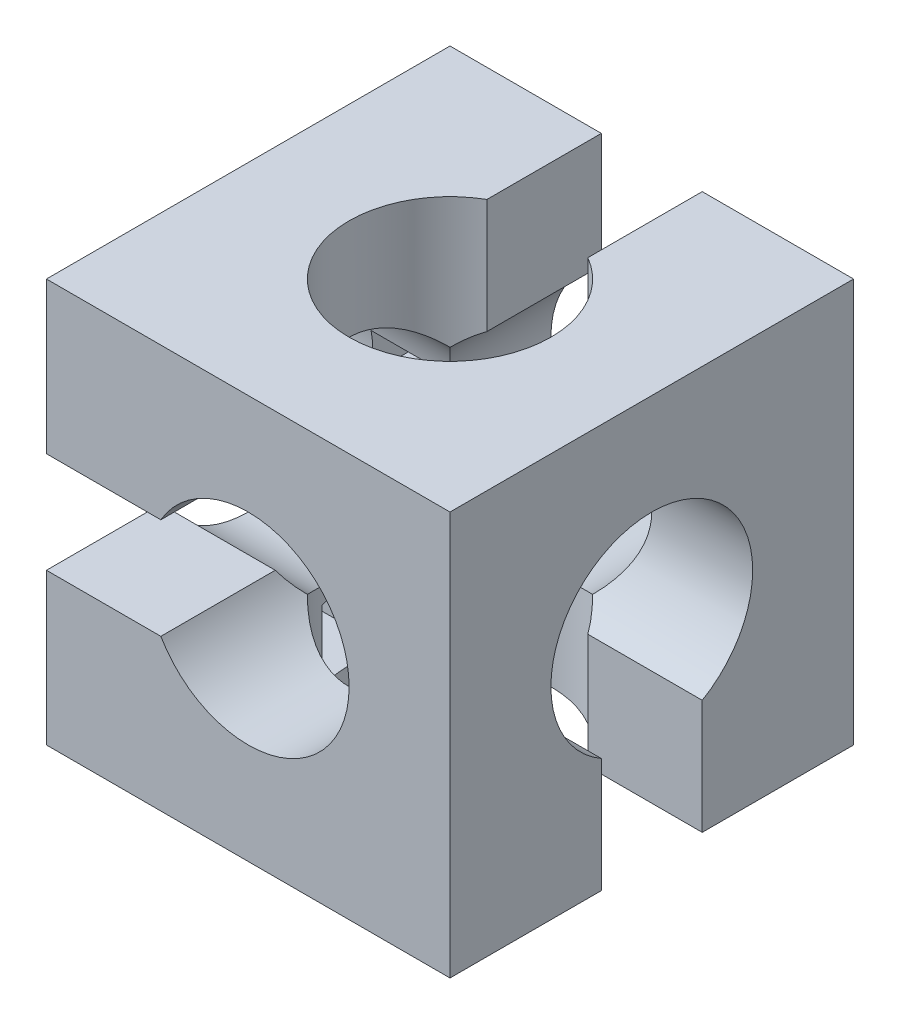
from build123d import *

# Parameters (mm, degrees)
ESQUISSE1_W              = 40
ESQUISSE1_H              = 40
BOSS_EXTRU_1_DEPTH       = 40
ENL_V_MAT_EXTRU_1_REACH  = 50.99
ESQUISSE2_R              = 10
ESQUISSE3_R              = 10
ENL_V_MAT_EXTRU_2_DEPTH  = 61
ESQUISSE5_R              = 10
ENL_V_MAT_EXTRU_3_DEPTH  = 61
ESQUISSE6_W              = 10
ESQUISSE6_H              = 27.836118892
ENL_V_MAT_EXTRU_4_DEPTH  = 20
ESQUISSE7_W              = 10
ESQUISSE7_H              = 29.671422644
ENL_V_MAT_EXTRU_5_DEPTH  = 20
ESQUISSE8_W              = 31.711885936
ESQUISSE8_H              = 10
ENL_V_MAT_EXTRU_6_DEPTH  = 20
ESQUISSE9_W              = 5.162771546
ESQUISSE9_H              = 4.139473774
ENL_V_MAT_EXTRU_7_DEPTH  = 37
ESQUISSE10_W             = 5.122117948
ESQUISSE10_H             = 3.690757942
ENL_V_MAT_EXTRU_8_DEPTH  = 37
ESQUISSE11_W             = 2.910802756
ESQUISSE11_H             = 4.763131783
ENL_V_MAT_EXTRU_9_DEPTH  = 37
ESQUISSE12_W             = 6.529063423
ESQUISSE12_H             = 7.044515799
ENL_V_MAT_EXTRU_10_DEPTH = 37


with BuildPart() as part:
    # Esquisse1 → Boss.-Extru.1 (new body)
    with BuildSketch(Plane.XY):
        Rectangle(ESQUISSE1_W, ESQUISSE1_H)
    extrude(amount=BOSS_EXTRU_1_DEPTH)

    # Esquisse2 → Enl_v. mat.-Extru.1 (cut, up to next)
    with BuildSketch(Plane.XY.offset(40), mode=Mode.PRIVATE) as enl_v_mat_extru_1_sk1:
        Circle(ESQUISSE2_R)
    enl_v_mat_extru_1_tool1 = extrude(enl_v_mat_extru_1_sk1.sketch, amount=-ENL_V_MAT_EXTRU_1_REACH, mode=Mode.PRIVATE) & part.part
    add(enl_v_mat_extru_1_tool1.solids().sort_by_distance((0, 0, 40))[0], mode=Mode.SUBTRACT)

    # Esquisse3 → Enl_v. mat.-Extru.2 (cut, through all)
    with BuildSketch(Plane.ZY.offset(20)):
        with Locations((20, 0)):
            Circle(ESQUISSE3_R)
    extrude(amount=-ENL_V_MAT_EXTRU_2_DEPTH, mode=Mode.SUBTRACT)

    # Esquisse5 → Enl_v. mat.-Extru.3 (cut, through all)
    with BuildSketch(Plane(origin=(0, 20, 0), x_dir=(1, 0, 0), z_dir=(0, 1, 0))):
        with Locations(Location((0, -20, 0), (0, 0, 270))):
            Circle(ESQUISSE5_R)
    extrude(amount=-ENL_V_MAT_EXTRU_3_DEPTH, mode=Mode.SUBTRACT)

    # Esquisse6 → Enl_v. mat.-Extru.4 (cut)
    with BuildSketch(Plane(origin=(0, 20, 0), x_dir=(1, 0, 0), z_dir=(0, 1, 0))):
        Rectangle(ESQUISSE6_W, ESQUISSE6_H)
    extrude(amount=-ENL_V_MAT_EXTRU_4_DEPTH, mode=Mode.SUBTRACT)

    # Esquisse7 → Enl_v. mat.-Extru.5 (cut)
    with BuildSketch(Plane(origin=(20, 0, 0), x_dir=(0, 0, -1), z_dir=(1, 0, 0))):
        with Locations((-20, -20)):
            Rectangle(ESQUISSE7_W, ESQUISSE7_H)
    extrude(amount=-ENL_V_MAT_EXTRU_5_DEPTH, mode=Mode.SUBTRACT)

    # Esquisse8 → Enl_v. mat.-Extru.6 (cut)
    with BuildSketch(Plane.XY.offset(40)):
        with Locations((-20, 0)):
            Rectangle(ESQUISSE8_W, ESQUISSE8_H)
    extrude(amount=-ENL_V_MAT_EXTRU_6_DEPTH, mode=Mode.SUBTRACT)

    # Esquisse9 → Enl_v. mat.-Extru.7 (cut)
    with BuildSketch(Plane.ZY.offset(20)):
        with Locations((34.809732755, 0)):
            Rectangle(ESQUISSE9_W, ESQUISSE9_H)
    extrude(amount=-ENL_V_MAT_EXTRU_7_DEPTH, mode=Mode.SUBTRACT)

    # Esquisse10 → Enl_v. mat.-Extru.8 (cut)
    with BuildSketch(Plane.XY.offset(40)):
        with Locations((-15.090948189, 0)):
            Rectangle(ESQUISSE10_W, ESQUISSE10_H)
    extrude(amount=-ENL_V_MAT_EXTRU_8_DEPTH, mode=Mode.SUBTRACT)

    # Esquisse11 → Enl_v. mat.-Extru.9 (cut)
    with BuildSketch(Plane(origin=(0, 0, 0), x_dir=(-1, 0, 0), z_dir=(0, 0, -1))):
        with Locations((0, 15.132967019)):
            Rectangle(ESQUISSE11_W, ESQUISSE11_H)
    extrude(amount=-ENL_V_MAT_EXTRU_9_DEPTH, mode=Mode.SUBTRACT)

    # Esquisse12 → Enl_v. mat.-Extru.10 (cut)
    with BuildSketch(Plane(origin=(20, 0, 0), x_dir=(0, 0, -1), z_dir=(1, 0, 0))):
        with Locations((-19.950729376, -14.647438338)):
            Rectangle(ESQUISSE12_W, ESQUISSE12_H)
    extrude(amount=-ENL_V_MAT_EXTRU_10_DEPTH, mode=Mode.SUBTRACT)


solid = part.part
